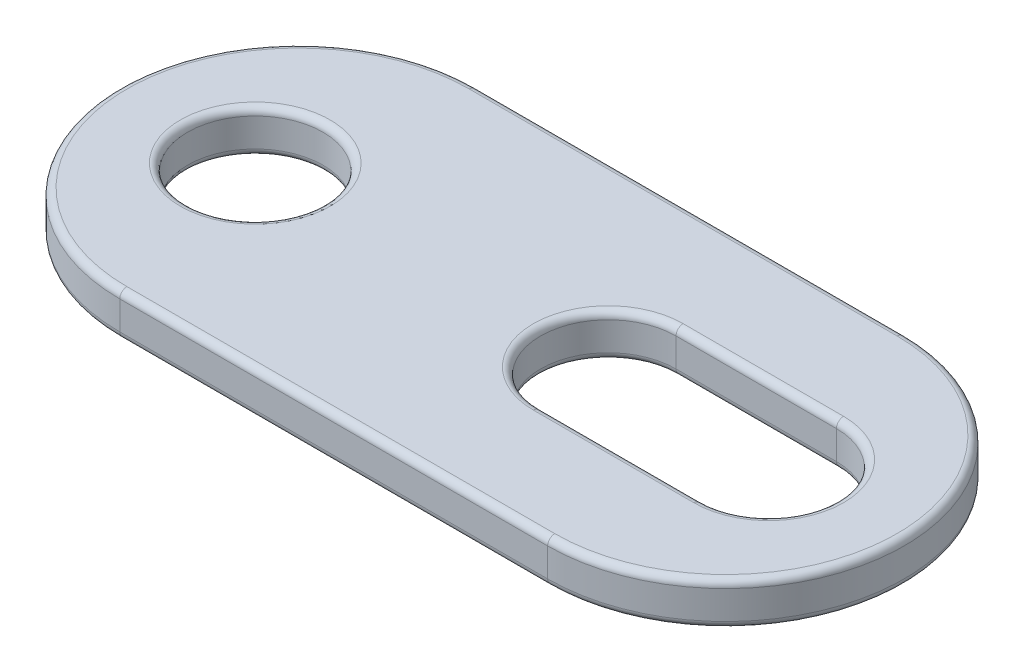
ISO-10303-21;
HEADER;
FILE_DESCRIPTION(('STEP AP214'),'2;1');
FILE_NAME('part.step','',(''),(''),'','','');
FILE_SCHEMA(('AUTOMOTIVE_DESIGN { 1 0 10303 214 1 1 1 1 }'));
ENDSEC;
DATA;
#1=APPLICATION_CONTEXT('core data for automotive mechanical design processes');
#2=APPLICATION_PROTOCOL_DEFINITION('international standard','automotive_design',2000,#1);
#3=PRODUCT_CONTEXT('',#1,'mechanical');
#4=PRODUCT('Part','Part','',(#3));
#5=PRODUCT_RELATED_PRODUCT_CATEGORY('part','',(#4));
#6=PRODUCT_DEFINITION_FORMATION('','',#4);
#7=PRODUCT_DEFINITION_CONTEXT('part definition',#1,'design');
#8=PRODUCT_DEFINITION('design','',#6,#7);
#9=PRODUCT_DEFINITION_SHAPE('','',#8);
#10=(LENGTH_UNIT() NAMED_UNIT(*) SI_UNIT(.MILLI.,.METRE.));
#11=(NAMED_UNIT(*) PLANE_ANGLE_UNIT() SI_UNIT($,.RADIAN.));
#12=(NAMED_UNIT(*) SI_UNIT($,.STERADIAN.) SOLID_ANGLE_UNIT());
#13=UNCERTAINTY_MEASURE_WITH_UNIT(LENGTH_MEASURE(1.E-05),#10,'distance_accuracy_value','');
#14=(GEOMETRIC_REPRESENTATION_CONTEXT(3) GLOBAL_UNCERTAINTY_ASSIGNED_CONTEXT((#13)) GLOBAL_UNIT_ASSIGNED_CONTEXT((#10,
#11,#12)) REPRESENTATION_CONTEXT('',''));
#15=CARTESIAN_POINT('',(0.,0.,0.));
#16=DIRECTION('',(0.,0.,1.));
#17=DIRECTION('',(1.,0.,0.));
#18=AXIS2_PLACEMENT_3D('',#15,#16,#17);
#19=CARTESIAN_POINT('',(0.,1.524,-6.35));
#20=DIRECTION('',(0.,1.,0.));
#21=DIRECTION('',(0.,0.,1.));
#22=AXIS2_PLACEMENT_3D('',#19,#20,#21);
#23=PLANE('',#22);
#24=DIRECTION('',(-1.,0.,0.));
#25=VECTOR('',#24,1.);
#26=CARTESIAN_POINT('',(0.,1.524,-9.017));
#27=LINE('',#26,#25);
#28=CARTESIAN_POINT('',(11.049,1.524,-9.017));
#29=VERTEX_POINT('',#28);
#30=CARTESIAN_POINT('',(16.764,1.524,-9.017));
#31=VERTEX_POINT('',#30);
#32=EDGE_CURVE('E44',#29,#31,#27,.F.);
#33=ORIENTED_EDGE('',*,*,#32,.T.);
#34=CARTESIAN_POINT('',(16.764,1.524,-6.35));
#35=DIRECTION('',(0.,1.,0.));
#36=DIRECTION('',(0.,0.,1.));
#37=AXIS2_PLACEMENT_3D('',#34,#35,#36);
#38=CIRCLE('',#37,2.667);
#39=CARTESIAN_POINT('',(16.764,1.524,-3.683));
#40=VERTEX_POINT('',#39);
#41=EDGE_CURVE('E12',#31,#40,#38,.F.);
#42=ORIENTED_EDGE('',*,*,#41,.T.);
#43=DIRECTION('',(1.,0.,0.));
#44=VECTOR('',#43,1.);
#45=CARTESIAN_POINT('',(0.,1.524,-3.683));
#46=LINE('',#45,#44);
#47=CARTESIAN_POINT('',(11.049,1.524,-3.683));
#48=VERTEX_POINT('',#47);
#49=EDGE_CURVE('E240',#40,#48,#46,.F.);
#50=ORIENTED_EDGE('',*,*,#49,.T.);
#51=CARTESIAN_POINT('',(11.049,1.524,-6.35));
#52=DIRECTION('',(0.,1.,0.));
#53=DIRECTION('',(0.,0.,1.));
#54=AXIS2_PLACEMENT_3D('',#51,#52,#53);
#55=CIRCLE('',#54,2.667);
#56=EDGE_CURVE('E54',#48,#29,#55,.F.);
#57=ORIENTED_EDGE('',*,*,#56,.T.);
#58=EDGE_LOOP('',(#33,#42,#50,#57));
#59=FACE_BOUND('',#58,.T.);
#60=CARTESIAN_POINT('',(15.24,1.524,-6.35));
#61=DIRECTION('',(0.,1.,0.));
#62=DIRECTION('',(0.,0.,1.));
#63=AXIS2_PLACEMENT_3D('',#60,#61,#62);
#64=CIRCLE('',#63,6.096);
#65=CARTESIAN_POINT('',(15.24,1.524,-0.254));
#66=VERTEX_POINT('',#65);
#67=CARTESIAN_POINT('',(15.24,1.524,-12.446));
#68=VERTEX_POINT('',#67);
#69=EDGE_CURVE('E235',#66,#68,#64,.T.);
#70=ORIENTED_EDGE('',*,*,#69,.T.);
#71=DIRECTION('',(-1.,0.,0.));
#72=VECTOR('',#71,1.);
#73=CARTESIAN_POINT('',(0.,1.524,-12.446));
#74=LINE('',#73,#72);
#75=CARTESIAN_POINT('',(0.,1.524,-12.446));
#76=VERTEX_POINT('',#75);
#77=EDGE_CURVE('E237',#68,#76,#74,.T.);
#78=ORIENTED_EDGE('',*,*,#77,.T.);
#79=CARTESIAN_POINT('',(0.,1.524,-6.35));
#80=DIRECTION('',(0.,1.,0.));
#81=DIRECTION('',(0.,0.,1.));
#82=AXIS2_PLACEMENT_3D('',#79,#80,#81);
#83=CIRCLE('',#82,6.096);
#84=CARTESIAN_POINT('',(0.,1.524,-0.254));
#85=VERTEX_POINT('',#84);
#86=EDGE_CURVE('E231',#76,#85,#83,.T.);
#87=ORIENTED_EDGE('',*,*,#86,.T.);
#88=DIRECTION('',(1.,0.,0.));
#89=VECTOR('',#88,1.);
#90=CARTESIAN_POINT('',(15.24,1.524,-0.254));
#91=LINE('',#90,#89);
#92=EDGE_CURVE('E233',#85,#66,#91,.T.);
#93=ORIENTED_EDGE('',*,*,#92,.T.);
#94=EDGE_LOOP('',(#70,#78,#87,#93));
#95=FACE_BOUND('',#94,.T.);
#96=CARTESIAN_POINT('',(-1.524,1.524,-6.35));
#97=DIRECTION('',(0.,1.,0.));
#98=DIRECTION('',(0.,0.,1.));
#99=AXIS2_PLACEMENT_3D('',#96,#97,#98);
#100=CIRCLE('',#99,2.667);
#101=CARTESIAN_POINT('',(-1.524,1.524,-3.683));
#102=VERTEX_POINT('',#101);
#103=EDGE_CURVE('E228',#102,#102,#100,.F.);
#104=ORIENTED_EDGE('',*,*,#103,.T.);
#105=EDGE_LOOP('',(#104));
#106=FACE_BOUND('',#105,.T.);
#107=ADVANCED_FACE('F36',(#59,#95,#106),#23,.T.);
#108=CARTESIAN_POINT('',(0.,0.,-6.35));
#109=DIRECTION('',(0.,1.,0.));
#110=DIRECTION('',(0.,0.,1.));
#111=AXIS2_PLACEMENT_3D('',#108,#109,#110);
#112=PLANE('',#111);
#113=CARTESIAN_POINT('',(16.764,0.,-6.35));
#114=DIRECTION('',(0.,1.,0.));
#115=DIRECTION('',(0.,0.,1.));
#116=AXIS2_PLACEMENT_3D('',#113,#114,#115);
#117=CIRCLE('',#116,2.667);
#118=CARTESIAN_POINT('',(16.764,0.,-3.683));
#119=VERTEX_POINT('',#118);
#120=CARTESIAN_POINT('',(16.764,0.,-9.017));
#121=VERTEX_POINT('',#120);
#122=EDGE_CURVE('E183',#119,#121,#117,.T.);
#123=ORIENTED_EDGE('',*,*,#122,.T.);
#124=DIRECTION('',(-1.,0.,0.));
#125=VECTOR('',#124,1.);
#126=CARTESIAN_POINT('',(11.049,0.,-9.017));
#127=LINE('',#126,#125);
#128=CARTESIAN_POINT('',(11.049,0.,-9.017));
#129=VERTEX_POINT('',#128);
#130=EDGE_CURVE('E185',#121,#129,#127,.T.);
#131=ORIENTED_EDGE('',*,*,#130,.T.);
#132=CARTESIAN_POINT('',(11.049,0.,-6.35));
#133=DIRECTION('',(0.,1.,0.));
#134=DIRECTION('',(0.,0.,1.));
#135=AXIS2_PLACEMENT_3D('',#132,#133,#134);
#136=CIRCLE('',#135,2.667);
#137=CARTESIAN_POINT('',(11.049,0.,-3.683));
#138=VERTEX_POINT('',#137);
#139=EDGE_CURVE('E175',#129,#138,#136,.T.);
#140=ORIENTED_EDGE('',*,*,#139,.T.);
#141=DIRECTION('',(1.,0.,0.));
#142=VECTOR('',#141,1.);
#143=CARTESIAN_POINT('',(16.764,0.,-3.683));
#144=LINE('',#143,#142);
#145=EDGE_CURVE('E177',#138,#119,#144,.T.);
#146=ORIENTED_EDGE('',*,*,#145,.T.);
#147=EDGE_LOOP('',(#123,#131,#140,#146));
#148=FACE_BOUND('',#147,.T.);
#149=CARTESIAN_POINT('',(15.24,0.,-6.35));
#150=DIRECTION('',(0.,1.,0.));
#151=DIRECTION('',(0.,0.,1.));
#152=AXIS2_PLACEMENT_3D('',#149,#150,#151);
#153=CIRCLE('',#152,6.096);
#154=CARTESIAN_POINT('',(15.24,0.,-12.446));
#155=VERTEX_POINT('',#154);
#156=CARTESIAN_POINT('',(15.24,0.,-0.254));
#157=VERTEX_POINT('',#156);
#158=EDGE_CURVE('E174',#155,#157,#153,.F.);
#159=ORIENTED_EDGE('',*,*,#158,.T.);
#160=DIRECTION('',(1.,0.,0.));
#161=VECTOR('',#160,1.);
#162=CARTESIAN_POINT('',(0.,0.,-0.254));
#163=LINE('',#162,#161);
#164=CARTESIAN_POINT('',(0.,0.,-0.254));
#165=VERTEX_POINT('',#164);
#166=EDGE_CURVE('E152',#157,#165,#163,.F.);
#167=ORIENTED_EDGE('',*,*,#166,.T.);
#168=CARTESIAN_POINT('',(0.,0.,-6.35));
#169=DIRECTION('',(0.,1.,0.));
#170=DIRECTION('',(0.,0.,1.));
#171=AXIS2_PLACEMENT_3D('',#168,#169,#170);
#172=CIRCLE('',#171,6.096);
#173=CARTESIAN_POINT('',(0.,0.,-12.446));
#174=VERTEX_POINT('',#173);
#175=EDGE_CURVE('E162',#165,#174,#172,.F.);
#176=ORIENTED_EDGE('',*,*,#175,.T.);
#177=DIRECTION('',(-1.,0.,0.));
#178=VECTOR('',#177,1.);
#179=CARTESIAN_POINT('',(0.,0.,-12.446));
#180=LINE('',#179,#178);
#181=EDGE_CURVE('E168',#174,#155,#180,.F.);
#182=ORIENTED_EDGE('',*,*,#181,.T.);
#183=EDGE_LOOP('',(#159,#167,#176,#182));
#184=FACE_BOUND('',#183,.T.);
#185=CARTESIAN_POINT('',(-1.524,0.,-6.35));
#186=DIRECTION('',(0.,1.,0.));
#187=DIRECTION('',(0.,0.,1.));
#188=AXIS2_PLACEMENT_3D('',#185,#186,#187);
#189=CIRCLE('',#188,2.667);
#190=CARTESIAN_POINT('',(-1.524,0.,-3.683));
#191=VERTEX_POINT('',#190);
#192=EDGE_CURVE('E169',#191,#191,#189,.T.);
#193=ORIENTED_EDGE('',*,*,#192,.T.);
#194=EDGE_LOOP('',(#193));
#195=FACE_BOUND('',#194,.T.);
#196=ADVANCED_FACE('F171',(#148,#184,#195),#112,.F.);
#197=CARTESIAN_POINT('',(0.,1.524,-6.35));
#198=DIRECTION('',(0.,-1.,0.));
#199=DIRECTION('',(0.,0.,-1.));
#200=AXIS2_PLACEMENT_3D('',#197,#198,#199);
#201=CYLINDRICAL_SURFACE('',#200,6.35);
#202=DIRECTION('',(0.,-1.,0.));
#203=VECTOR('',#202,1.);
#204=CARTESIAN_POINT('',(0.,1.524,-12.7));
#205=LINE('',#204,#203);
#206=CARTESIAN_POINT('',(0.,1.27,-12.7));
#207=VERTEX_POINT('',#206);
#208=CARTESIAN_POINT('',(0.,0.254000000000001,-12.7));
#209=VERTEX_POINT('',#208);
#210=EDGE_CURVE('E287',#207,#209,#205,.T.);
#211=ORIENTED_EDGE('',*,*,#210,.T.);
#212=CARTESIAN_POINT('',(0.,0.254,-6.35));
#213=DIRECTION('',(0.,1.,0.));
#214=DIRECTION('',(0.,0.,1.));
#215=AXIS2_PLACEMENT_3D('',#212,#213,#214);
#216=CIRCLE('',#215,6.35);
#217=CARTESIAN_POINT('',(0.,0.254000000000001,0.));
#218=VERTEX_POINT('',#217);
#219=EDGE_CURVE('E220',#209,#218,#216,.T.);
#220=ORIENTED_EDGE('',*,*,#219,.T.);
#221=DIRECTION('',(0.,-1.,0.));
#222=VECTOR('',#221,1.);
#223=CARTESIAN_POINT('',(0.,1.524,0.));
#224=LINE('',#223,#222);
#225=CARTESIAN_POINT('',(0.,1.27,0.));
#226=VERTEX_POINT('',#225);
#227=EDGE_CURVE('E296',#226,#218,#224,.T.);
#228=ORIENTED_EDGE('',*,*,#227,.F.);
#229=CARTESIAN_POINT('',(0.,1.27,-6.35));
#230=DIRECTION('',(0.,1.,0.));
#231=DIRECTION('',(0.,0.,1.));
#232=AXIS2_PLACEMENT_3D('',#229,#230,#231);
#233=CIRCLE('',#232,6.35);
#234=EDGE_CURVE('E218',#226,#207,#233,.F.);
#235=ORIENTED_EDGE('',*,*,#234,.T.);
#236=EDGE_LOOP('',(#211,#220,#228,#235));
#237=FACE_BOUND('',#236,.T.);
#238=ADVANCED_FACE('F38',(#237),#201,.T.);
#239=CARTESIAN_POINT('',(0.,1.524,0.));
#240=DIRECTION('',(0.,0.,-1.));
#241=DIRECTION('',(-1.,0.,0.));
#242=AXIS2_PLACEMENT_3D('',#239,#240,#241);
#243=PLANE('',#242);
#244=ORIENTED_EDGE('',*,*,#227,.T.);
#245=DIRECTION('',(1.,0.,0.));
#246=VECTOR('',#245,1.);
#247=CARTESIAN_POINT('',(0.,0.254,0.));
#248=LINE('',#247,#246);
#249=CARTESIAN_POINT('',(15.24,0.254000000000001,0.));
#250=VERTEX_POINT('',#249);
#251=EDGE_CURVE('E155',#218,#250,#248,.T.);
#252=ORIENTED_EDGE('',*,*,#251,.T.);
#253=DIRECTION('',(0.,-1.,0.));
#254=VECTOR('',#253,1.);
#255=CARTESIAN_POINT('',(15.24,1.524,0.));
#256=LINE('',#255,#254);
#257=CARTESIAN_POINT('',(15.24,1.27,0.));
#258=VERTEX_POINT('',#257);
#259=EDGE_CURVE('E293',#258,#250,#256,.T.);
#260=ORIENTED_EDGE('',*,*,#259,.F.);
#261=DIRECTION('',(1.,0.,0.));
#262=VECTOR('',#261,1.);
#263=CARTESIAN_POINT('',(0.,1.27,0.));
#264=LINE('',#263,#262);
#265=EDGE_CURVE('E206',#258,#226,#264,.F.);
#266=ORIENTED_EDGE('',*,*,#265,.T.);
#267=EDGE_LOOP('',(#244,#252,#260,#266));
#268=FACE_BOUND('',#267,.T.);
#269=ADVANCED_FACE('F311',(#268),#243,.F.);
#270=CARTESIAN_POINT('',(15.24,1.524,-6.35));
#271=DIRECTION('',(0.,-1.,0.));
#272=DIRECTION('',(0.,0.,-1.));
#273=AXIS2_PLACEMENT_3D('',#270,#271,#272);
#274=CYLINDRICAL_SURFACE('',#273,6.35);
#275=ORIENTED_EDGE('',*,*,#259,.T.);
#276=CARTESIAN_POINT('',(15.24,0.254,-6.35));
#277=DIRECTION('',(0.,1.,0.));
#278=DIRECTION('',(0.,0.,1.));
#279=AXIS2_PLACEMENT_3D('',#276,#277,#278);
#280=CIRCLE('',#279,6.35);
#281=CARTESIAN_POINT('',(15.24,0.254000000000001,-12.7));
#282=VERTEX_POINT('',#281);
#283=EDGE_CURVE('E211',#250,#282,#280,.T.);
#284=ORIENTED_EDGE('',*,*,#283,.T.);
#285=DIRECTION('',(0.,-1.,0.));
#286=VECTOR('',#285,1.);
#287=CARTESIAN_POINT('',(15.24,1.524,-12.7));
#288=LINE('',#287,#286);
#289=CARTESIAN_POINT('',(15.24,1.27,-12.7));
#290=VERTEX_POINT('',#289);
#291=EDGE_CURVE('E290',#290,#282,#288,.T.);
#292=ORIENTED_EDGE('',*,*,#291,.F.);
#293=CARTESIAN_POINT('',(15.24,1.27,-6.35));
#294=DIRECTION('',(0.,1.,0.));
#295=DIRECTION('',(0.,0.,1.));
#296=AXIS2_PLACEMENT_3D('',#293,#294,#295);
#297=CIRCLE('',#296,6.35);
#298=EDGE_CURVE('E209',#290,#258,#297,.F.);
#299=ORIENTED_EDGE('',*,*,#298,.T.);
#300=EDGE_LOOP('',(#275,#284,#292,#299));
#301=FACE_BOUND('',#300,.T.);
#302=ADVANCED_FACE('F314',(#301),#274,.T.);
#303=CARTESIAN_POINT('',(0.,1.524,-12.7));
#304=DIRECTION('',(0.,0.,1.));
#305=DIRECTION('',(1.,0.,0.));
#306=AXIS2_PLACEMENT_3D('',#303,#304,#305);
#307=PLANE('',#306);
#308=ORIENTED_EDGE('',*,*,#291,.T.);
#309=DIRECTION('',(-1.,0.,0.));
#310=VECTOR('',#309,1.);
#311=CARTESIAN_POINT('',(0.,0.254,-12.7));
#312=LINE('',#311,#310);
#313=EDGE_CURVE('E216',#282,#209,#312,.T.);
#314=ORIENTED_EDGE('',*,*,#313,.T.);
#315=ORIENTED_EDGE('',*,*,#210,.F.);
#316=DIRECTION('',(-1.,0.,0.));
#317=VECTOR('',#316,1.);
#318=CARTESIAN_POINT('',(15.24,1.27,-12.7));
#319=LINE('',#318,#317);
#320=EDGE_CURVE('E213',#207,#290,#319,.F.);
#321=ORIENTED_EDGE('',*,*,#320,.T.);
#322=EDGE_LOOP('',(#308,#314,#315,#321));
#323=FACE_BOUND('',#322,.T.);
#324=ADVANCED_FACE('F328',(#323),#307,.F.);
#325=CARTESIAN_POINT('',(-1.524,1.524,-6.35));
#326=DIRECTION('',(0.,-1.,0.));
#327=DIRECTION('',(0.,0.,-1.));
#328=AXIS2_PLACEMENT_3D('',#325,#326,#327);
#329=CYLINDRICAL_SURFACE('',#328,2.413);
#330=CARTESIAN_POINT('',(-1.524,0.254,-6.35));
#331=DIRECTION('',(0.,1.,0.));
#332=DIRECTION('',(0.,0.,1.));
#333=AXIS2_PLACEMENT_3D('',#330,#331,#332);
#334=CIRCLE('',#333,2.413);
#335=CARTESIAN_POINT('',(-1.524,0.254,-8.763));
#336=VERTEX_POINT('',#335);
#337=EDGE_CURVE('E225',#336,#336,#334,.F.);
#338=CARTESIAN_POINT('',(-1.524,1.27,-6.35));
#339=DIRECTION('',(0.,1.,0.));
#340=DIRECTION('',(0.,0.,1.));
#341=AXIS2_PLACEMENT_3D('',#338,#339,#340);
#342=CIRCLE('',#341,2.413);
#343=CARTESIAN_POINT('',(-1.524,1.27,-8.763));
#344=VERTEX_POINT('',#343);
#345=EDGE_CURVE('E222',#344,#344,#342,.T.);
#346=CARTESIAN_POINT('',(-1.524,0.254,-8.763));
#347=CARTESIAN_POINT('',(-1.524,0.264583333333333,-8.763));
#348=CARTESIAN_POINT('',(-1.524,0.275166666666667,-8.763));
#349=CARTESIAN_POINT('',(-1.524,0.296333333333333,-8.763));
#350=CARTESIAN_POINT('',(-1.524,0.306916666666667,-8.763));
#351=CARTESIAN_POINT('',(-1.524,0.328083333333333,-8.763));
#352=CARTESIAN_POINT('',(-1.524,0.338666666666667,-8.763));
#353=CARTESIAN_POINT('',(-1.524,0.359833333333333,-8.763));
#354=CARTESIAN_POINT('',(-1.524,0.370416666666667,-8.763));
#355=CARTESIAN_POINT('',(-1.524,0.391583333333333,-8.763));
#356=CARTESIAN_POINT('',(-1.524,0.402166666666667,-8.763));
#357=CARTESIAN_POINT('',(-1.524,0.423333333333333,-8.763));
#358=CARTESIAN_POINT('',(-1.524,0.433916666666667,-8.763));
#359=CARTESIAN_POINT('',(-1.524,0.455083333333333,-8.763));
#360=CARTESIAN_POINT('',(-1.524,0.465666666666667,-8.763));
#361=CARTESIAN_POINT('',(-1.524,0.486833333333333,-8.763));
#362=CARTESIAN_POINT('',(-1.524,0.497416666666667,-8.763));
#363=CARTESIAN_POINT('',(-1.524,0.518583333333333,-8.763));
#364=CARTESIAN_POINT('',(-1.524,0.529166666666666,-8.763));
#365=CARTESIAN_POINT('',(-1.524,0.550333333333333,-8.763));
#366=CARTESIAN_POINT('',(-1.524,0.560916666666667,-8.763));
#367=CARTESIAN_POINT('',(-1.524,0.582083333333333,-8.763));
#368=CARTESIAN_POINT('',(-1.524,0.592666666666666,-8.763));
#369=CARTESIAN_POINT('',(-1.524,0.613833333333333,-8.763));
#370=CARTESIAN_POINT('',(-1.524,0.624416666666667,-8.763));
#371=CARTESIAN_POINT('',(-1.524,0.645583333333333,-8.763));
#372=CARTESIAN_POINT('',(-1.524,0.656166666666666,-8.763));
#373=CARTESIAN_POINT('',(-1.524,0.677333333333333,-8.763));
#374=CARTESIAN_POINT('',(-1.524,0.687916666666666,-8.763));
#375=CARTESIAN_POINT('',(-1.524,0.709083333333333,-8.763));
#376=CARTESIAN_POINT('',(-1.524,0.719666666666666,-8.763));
#377=CARTESIAN_POINT('',(-1.524,0.740833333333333,-8.763));
#378=CARTESIAN_POINT('',(-1.524,0.751416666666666,-8.763));
#379=CARTESIAN_POINT('',(-1.524,0.772583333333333,-8.763));
#380=CARTESIAN_POINT('',(-1.524,0.783166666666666,-8.763));
#381=CARTESIAN_POINT('',(-1.524,0.804333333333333,-8.763));
#382=CARTESIAN_POINT('',(-1.524,0.814916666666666,-8.763));
#383=CARTESIAN_POINT('',(-1.524,0.836083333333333,-8.763));
#384=CARTESIAN_POINT('',(-1.524,0.846666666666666,-8.763));
#385=CARTESIAN_POINT('',(-1.524,0.867833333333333,-8.763));
#386=CARTESIAN_POINT('',(-1.524,0.878416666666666,-8.763));
#387=CARTESIAN_POINT('',(-1.524,0.899583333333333,-8.763));
#388=CARTESIAN_POINT('',(-1.524,0.910166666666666,-8.763));
#389=CARTESIAN_POINT('',(-1.524,0.931333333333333,-8.763));
#390=CARTESIAN_POINT('',(-1.524,0.941916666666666,-8.763));
#391=CARTESIAN_POINT('',(-1.524,0.963083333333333,-8.763));
#392=CARTESIAN_POINT('',(-1.524,0.973666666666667,-8.763));
#393=CARTESIAN_POINT('',(-1.524,0.994833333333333,-8.763));
#394=CARTESIAN_POINT('',(-1.524,1.00541666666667,-8.763));
#395=CARTESIAN_POINT('',(-1.524,1.02658333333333,-8.763));
#396=CARTESIAN_POINT('',(-1.524,1.03716666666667,-8.763));
#397=CARTESIAN_POINT('',(-1.524,1.05833333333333,-8.763));
#398=CARTESIAN_POINT('',(-1.524,1.06891666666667,-8.763));
#399=CARTESIAN_POINT('',(-1.524,1.09008333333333,-8.763));
#400=CARTESIAN_POINT('',(-1.524,1.10066666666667,-8.763));
#401=CARTESIAN_POINT('',(-1.524,1.12183333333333,-8.763));
#402=CARTESIAN_POINT('',(-1.524,1.13241666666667,-8.763));
#403=CARTESIAN_POINT('',(-1.524,1.15358333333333,-8.763));
#404=CARTESIAN_POINT('',(-1.524,1.16416666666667,-8.763));
#405=CARTESIAN_POINT('',(-1.524,1.18533333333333,-8.763));
#406=CARTESIAN_POINT('',(-1.524,1.19591666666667,-8.763));
#407=CARTESIAN_POINT('',(-1.524,1.21708333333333,-8.763));
#408=CARTESIAN_POINT('',(-1.524,1.22766666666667,-8.763));
#409=CARTESIAN_POINT('',(-1.524,1.24883333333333,-8.763));
#410=CARTESIAN_POINT('',(-1.524,1.25941666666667,-8.763));
#411=CARTESIAN_POINT('',(-1.524,1.27,-8.763));
#412=B_SPLINE_CURVE_WITH_KNOTS('',3,(#346,#347,#348,#349,#350,#351,#352,#353,#354,#355,#356,
#357,#358,#359,#360,#361,#362,#363,#364,#365,#366,#367,#368,#369,#370,#371,#372,#373,#374,#375,
#376,#377,#378,#379,#380,#381,#382,#383,#384,#385,#386,#387,#388,#389,#390,#391,#392,#393,#394,
#395,#396,#397,#398,#399,#400,#401,#402,#403,#404,#405,#406,#407,#408,#409,#410,#411),
.UNSPECIFIED.,.F.,.F.,(4,2,2,2,2,2,2,2,2,2,2,2,2,2,2,2,2,2,2,2,2,2,2,2,2,2,2,2,2,2,2,2,4),(0.,
0.0317500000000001,0.0635,0.0952500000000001,0.127,0.15875,0.1905,0.22225,0.254,0.28575,0.3175,
0.34925,0.381,0.41275,0.4445,0.47625,0.508,0.53975,0.5715,0.60325,0.635,0.66675,0.6985,0.73025,
0.762,0.79375,0.8255,0.85725,0.889,0.92075,0.9525,0.98425,1.016),.UNSPECIFIED.);
#413=EDGE_CURVE('BSEAM399',#336,#344,#412,.T.);
#414=ORIENTED_EDGE('',*,*,#337,.T.);
#415=ORIENTED_EDGE('',*,*,#345,.T.);
#416=ORIENTED_EDGE('',*,*,#413,.T.);
#417=ORIENTED_EDGE('',*,*,#413,.F.);
#418=EDGE_LOOP('',(#414,#416,#415,#417));
#419=FACE_BOUND('',#418,.T.);
#420=ADVANCED_FACE('F399',(#419),#329,.F.);
#421=CARTESIAN_POINT('',(11.049,1.524,-6.35));
#422=DIRECTION('',(0.,-1.,0.));
#423=DIRECTION('',(0.,0.,-1.));
#424=AXIS2_PLACEMENT_3D('',#421,#422,#423);
#425=CYLINDRICAL_SURFACE('',#424,2.413);
#426=DIRECTION('',(0.,-1.,0.));
#427=VECTOR('',#426,1.);
#428=CARTESIAN_POINT('',(11.049,1.524,-3.937));
#429=LINE('',#428,#427);
#430=CARTESIAN_POINT('',(11.049,1.27,-3.937));
#431=VERTEX_POINT('',#430);
#432=CARTESIAN_POINT('',(11.049,0.254000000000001,-3.937));
#433=VERTEX_POINT('',#432);
#434=EDGE_CURVE('E284',#431,#433,#429,.T.);
#435=ORIENTED_EDGE('',*,*,#434,.T.);
#436=CARTESIAN_POINT('',(11.049,0.254,-6.35));
#437=DIRECTION('',(0.,1.,0.));
#438=DIRECTION('',(0.,0.,1.));
#439=AXIS2_PLACEMENT_3D('',#436,#437,#438);
#440=CIRCLE('',#439,2.413);
#441=CARTESIAN_POINT('',(11.049,0.254000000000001,-8.763));
#442=VERTEX_POINT('',#441);
#443=EDGE_CURVE('E204',#433,#442,#440,.F.);
#444=ORIENTED_EDGE('',*,*,#443,.T.);
#445=DIRECTION('',(0.,-1.,0.));
#446=VECTOR('',#445,1.);
#447=CARTESIAN_POINT('',(11.049,1.524,-8.763));
#448=LINE('',#447,#446);
#449=CARTESIAN_POINT('',(11.049,1.27,-8.763));
#450=VERTEX_POINT('',#449);
#451=EDGE_CURVE('E275',#450,#442,#448,.T.);
#452=ORIENTED_EDGE('',*,*,#451,.F.);
#453=CARTESIAN_POINT('',(11.049,1.27,-6.35));
#454=DIRECTION('',(0.,1.,0.));
#455=DIRECTION('',(0.,0.,1.));
#456=AXIS2_PLACEMENT_3D('',#453,#454,#455);
#457=CIRCLE('',#456,2.413);
#458=EDGE_CURVE('E202',#450,#431,#457,.T.);
#459=ORIENTED_EDGE('',*,*,#458,.T.);
#460=EDGE_LOOP('',(#435,#444,#452,#459));
#461=FACE_BOUND('',#460,.T.);
#462=ADVANCED_FACE('F422',(#461),#425,.F.);
#463=CARTESIAN_POINT('',(11.049,1.524,-3.937));
#464=DIRECTION('',(0.,0.,-1.));
#465=DIRECTION('',(-1.,0.,0.));
#466=AXIS2_PLACEMENT_3D('',#463,#464,#465);
#467=PLANE('',#466);
#468=DIRECTION('',(0.,-1.,0.));
#469=VECTOR('',#468,1.);
#470=CARTESIAN_POINT('',(16.764,1.524,-3.937));
#471=LINE('',#470,#469);
#472=CARTESIAN_POINT('',(16.764,1.27,-3.937));
#473=VERTEX_POINT('',#472);
#474=CARTESIAN_POINT('',(16.764,0.254000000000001,-3.937));
#475=VERTEX_POINT('',#474);
#476=EDGE_CURVE('E281',#473,#475,#471,.T.);
#477=ORIENTED_EDGE('',*,*,#476,.T.);
#478=DIRECTION('',(1.,0.,0.));
#479=VECTOR('',#478,1.);
#480=CARTESIAN_POINT('',(11.049,0.254,-3.937));
#481=LINE('',#480,#479);
#482=EDGE_CURVE('E200',#475,#433,#481,.F.);
#483=ORIENTED_EDGE('',*,*,#482,.T.);
#484=ORIENTED_EDGE('',*,*,#434,.F.);
#485=DIRECTION('',(1.,0.,0.));
#486=VECTOR('',#485,1.);
#487=CARTESIAN_POINT('',(11.049,1.27,-3.937));
#488=LINE('',#487,#486);
#489=EDGE_CURVE('E198',#431,#473,#488,.T.);
#490=ORIENTED_EDGE('',*,*,#489,.T.);
#491=EDGE_LOOP('',(#477,#483,#484,#490));
#492=FACE_BOUND('',#491,.T.);
#493=ADVANCED_FACE('F377',(#492),#467,.T.);
#494=CARTESIAN_POINT('',(16.764,1.524,-6.35));
#495=DIRECTION('',(0.,-1.,0.));
#496=DIRECTION('',(0.,0.,-1.));
#497=AXIS2_PLACEMENT_3D('',#494,#495,#496);
#498=CYLINDRICAL_SURFACE('',#497,2.413);
#499=DIRECTION('',(0.,-1.,0.));
#500=VECTOR('',#499,1.);
#501=CARTESIAN_POINT('',(16.764,1.524,-8.763));
#502=LINE('',#501,#500);
#503=CARTESIAN_POINT('',(16.764,1.27,-8.763));
#504=VERTEX_POINT('',#503);
#505=CARTESIAN_POINT('',(16.764,0.254000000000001,-8.763));
#506=VERTEX_POINT('',#505);
#507=EDGE_CURVE('E278',#504,#506,#502,.T.);
#508=ORIENTED_EDGE('',*,*,#507,.T.);
#509=CARTESIAN_POINT('',(16.764,0.254,-6.35));
#510=DIRECTION('',(0.,1.,0.));
#511=DIRECTION('',(0.,0.,1.));
#512=AXIS2_PLACEMENT_3D('',#509,#510,#511);
#513=CIRCLE('',#512,2.413);
#514=EDGE_CURVE('E196',#506,#475,#513,.F.);
#515=ORIENTED_EDGE('',*,*,#514,.T.);
#516=ORIENTED_EDGE('',*,*,#476,.F.);
#517=CARTESIAN_POINT('',(16.764,1.27,-6.35));
#518=DIRECTION('',(0.,1.,0.));
#519=DIRECTION('',(0.,0.,1.));
#520=AXIS2_PLACEMENT_3D('',#517,#518,#519);
#521=CIRCLE('',#520,2.413);
#522=EDGE_CURVE('E193',#473,#504,#521,.T.);
#523=ORIENTED_EDGE('',*,*,#522,.T.);
#524=EDGE_LOOP('',(#508,#515,#516,#523));
#525=FACE_BOUND('',#524,.T.);
#526=ADVANCED_FACE('F353',(#525),#498,.F.);
#527=CARTESIAN_POINT('',(11.049,1.524,-8.763));
#528=DIRECTION('',(0.,0.,1.));
#529=DIRECTION('',(1.,0.,0.));
#530=AXIS2_PLACEMENT_3D('',#527,#528,#529);
#531=PLANE('',#530);
#532=ORIENTED_EDGE('',*,*,#451,.T.);
#533=DIRECTION('',(-1.,0.,0.));
#534=VECTOR('',#533,1.);
#535=CARTESIAN_POINT('',(16.764,0.254,-8.763));
#536=LINE('',#535,#534);
#537=EDGE_CURVE('E190',#442,#506,#536,.F.);
#538=ORIENTED_EDGE('',*,*,#537,.T.);
#539=ORIENTED_EDGE('',*,*,#507,.F.);
#540=DIRECTION('',(-1.,0.,0.));
#541=VECTOR('',#540,1.);
#542=CARTESIAN_POINT('',(11.049,1.27,-8.763));
#543=LINE('',#542,#541);
#544=EDGE_CURVE('E188',#504,#450,#543,.T.);
#545=ORIENTED_EDGE('',*,*,#544,.T.);
#546=EDGE_LOOP('',(#532,#538,#539,#545));
#547=FACE_BOUND('',#546,.T.);
#548=ADVANCED_FACE('F355',(#547),#531,.T.);
#549=CARTESIAN_POINT('',(0.,0.254,-3.683));
#550=DIRECTION('',(-1.,0.,0.));
#551=DIRECTION('',(0.,0.,1.));
#552=AXIS2_PLACEMENT_3D('',#549,#550,#551);
#553=CYLINDRICAL_SURFACE('',#552,0.254);
#554=CARTESIAN_POINT('',(11.049,0.254,-3.683));
#555=DIRECTION('',(-1.,0.,0.));
#556=DIRECTION('',(0.,0.,1.));
#557=AXIS2_PLACEMENT_3D('',#554,#555,#556);
#558=CIRCLE('',#557,0.254);
#559=EDGE_CURVE('E269',#433,#138,#558,.T.);
#560=ORIENTED_EDGE('',*,*,#559,.F.);
#561=ORIENTED_EDGE('',*,*,#482,.F.);
#562=CARTESIAN_POINT('',(16.764,0.254,-3.683));
#563=DIRECTION('',(1.,0.,0.));
#564=DIRECTION('',(0.,0.,-1.));
#565=AXIS2_PLACEMENT_3D('',#562,#563,#564);
#566=CIRCLE('',#565,0.254);
#567=EDGE_CURVE('E272',#119,#475,#566,.T.);
#568=ORIENTED_EDGE('',*,*,#567,.F.);
#569=ORIENTED_EDGE('',*,*,#145,.F.);
#570=EDGE_LOOP('',(#560,#561,#568,#569));
#571=FACE_BOUND('',#570,.T.);
#572=ADVANCED_FACE('F380',(#571),#553,.T.);
#573=CARTESIAN_POINT('',(16.764,0.254,-6.35));
#574=DIRECTION('',(0.,1.,0.));
#575=DIRECTION('',(0.,0.,1.));
#576=AXIS2_PLACEMENT_3D('',#573,#574,#575);
#577=TOROIDAL_SURFACE('',#576,2.667,0.254);
#578=ORIENTED_EDGE('',*,*,#567,.T.);
#579=ORIENTED_EDGE('',*,*,#514,.F.);
#580=CARTESIAN_POINT('',(16.764,0.254,-9.017));
#581=DIRECTION('',(-1.,0.,0.));
#582=DIRECTION('',(0.,0.,1.));
#583=AXIS2_PLACEMENT_3D('',#580,#581,#582);
#584=CIRCLE('',#583,0.254);
#585=EDGE_CURVE('E267',#121,#506,#584,.T.);
#586=ORIENTED_EDGE('',*,*,#585,.F.);
#587=ORIENTED_EDGE('',*,*,#122,.F.);
#588=EDGE_LOOP('',(#578,#579,#586,#587));
#589=FACE_BOUND('',#588,.T.);
#590=ADVANCED_FACE('F374',(#589),#577,.T.);
#591=CARTESIAN_POINT('',(11.049,0.254,-6.35));
#592=DIRECTION('',(0.,1.,0.));
#593=DIRECTION('',(0.,0.,1.));
#594=AXIS2_PLACEMENT_3D('',#591,#592,#593);
#595=TOROIDAL_SURFACE('',#594,2.667,0.254);
#596=ORIENTED_EDGE('',*,*,#559,.T.);
#597=ORIENTED_EDGE('',*,*,#139,.F.);
#598=CARTESIAN_POINT('',(11.049,0.254,-9.017));
#599=DIRECTION('',(1.,0.,0.));
#600=DIRECTION('',(0.,0.,-1.));
#601=AXIS2_PLACEMENT_3D('',#598,#599,#600);
#602=CIRCLE('',#601,0.254);
#603=EDGE_CURVE('E265',#442,#129,#602,.T.);
#604=ORIENTED_EDGE('',*,*,#603,.F.);
#605=ORIENTED_EDGE('',*,*,#443,.F.);
#606=EDGE_LOOP('',(#596,#597,#604,#605));
#607=FACE_BOUND('',#606,.T.);
#608=ADVANCED_FACE('F367',(#607),#595,.T.);
#609=CARTESIAN_POINT('',(0.,0.254,-9.017));
#610=DIRECTION('',(1.,0.,0.));
#611=DIRECTION('',(0.,0.,-1.));
#612=AXIS2_PLACEMENT_3D('',#609,#610,#611);
#613=CYLINDRICAL_SURFACE('',#612,0.254);
#614=ORIENTED_EDGE('',*,*,#585,.T.);
#615=ORIENTED_EDGE('',*,*,#537,.F.);
#616=ORIENTED_EDGE('',*,*,#603,.T.);
#617=ORIENTED_EDGE('',*,*,#130,.F.);
#618=EDGE_LOOP('',(#614,#615,#616,#617));
#619=FACE_BOUND('',#618,.T.);
#620=ADVANCED_FACE('F360',(#619),#613,.T.);
#621=CARTESIAN_POINT('',(0.,0.254,-12.446));
#622=DIRECTION('',(-1.,0.,0.));
#623=DIRECTION('',(0.,0.,1.));
#624=AXIS2_PLACEMENT_3D('',#621,#622,#623);
#625=CYLINDRICAL_SURFACE('',#624,0.254);
#626=CARTESIAN_POINT('',(15.24,0.254,-12.446));
#627=DIRECTION('',(1.,0.,0.));
#628=DIRECTION('',(0.,0.,-1.));
#629=AXIS2_PLACEMENT_3D('',#626,#627,#628);
#630=CIRCLE('',#629,0.254);
#631=EDGE_CURVE('E158',#155,#282,#630,.T.);
#632=ORIENTED_EDGE('',*,*,#631,.F.);
#633=ORIENTED_EDGE('',*,*,#181,.F.);
#634=CARTESIAN_POINT('',(0.,0.254,-12.446));
#635=DIRECTION('',(-1.,0.,0.));
#636=DIRECTION('',(0.,0.,1.));
#637=AXIS2_PLACEMENT_3D('',#634,#635,#636);
#638=CIRCLE('',#637,0.254);
#639=EDGE_CURVE('E165',#209,#174,#638,.T.);
#640=ORIENTED_EDGE('',*,*,#639,.F.);
#641=ORIENTED_EDGE('',*,*,#313,.F.);
#642=EDGE_LOOP('',(#632,#633,#640,#641));
#643=FACE_BOUND('',#642,.T.);
#644=ADVANCED_FACE('F303',(#643),#625,.T.);
#645=CARTESIAN_POINT('',(0.,0.254,-6.35));
#646=DIRECTION('',(0.,1.,0.));
#647=DIRECTION('',(0.,0.,1.));
#648=AXIS2_PLACEMENT_3D('',#645,#646,#647);
#649=TOROIDAL_SURFACE('',#648,6.096,0.254);
#650=ORIENTED_EDGE('',*,*,#639,.T.);
#651=ORIENTED_EDGE('',*,*,#175,.F.);
#652=CARTESIAN_POINT('',(0.,0.254,-0.254));
#653=DIRECTION('',(1.,0.,0.));
#654=DIRECTION('',(0.,0.,-1.));
#655=AXIS2_PLACEMENT_3D('',#652,#653,#654);
#656=CIRCLE('',#655,0.254);
#657=EDGE_CURVE('E148',#218,#165,#656,.T.);
#658=ORIENTED_EDGE('',*,*,#657,.F.);
#659=ORIENTED_EDGE('',*,*,#219,.F.);
#660=EDGE_LOOP('',(#650,#651,#658,#659));
#661=FACE_BOUND('',#660,.T.);
#662=ADVANCED_FACE('F163',(#661),#649,.T.);
#663=CARTESIAN_POINT('',(15.24,0.254,-6.35));
#664=DIRECTION('',(0.,1.,0.));
#665=DIRECTION('',(0.,0.,1.));
#666=AXIS2_PLACEMENT_3D('',#663,#664,#665);
#667=TOROIDAL_SURFACE('',#666,6.096,0.254);
#668=ORIENTED_EDGE('',*,*,#631,.T.);
#669=ORIENTED_EDGE('',*,*,#283,.F.);
#670=CARTESIAN_POINT('',(15.24,0.254,-0.254));
#671=DIRECTION('',(-1.,0.,0.));
#672=DIRECTION('',(0.,0.,1.));
#673=AXIS2_PLACEMENT_3D('',#670,#671,#672);
#674=CIRCLE('',#673,0.254);
#675=EDGE_CURVE('E159',#157,#250,#674,.T.);
#676=ORIENTED_EDGE('',*,*,#675,.F.);
#677=ORIENTED_EDGE('',*,*,#158,.F.);
#678=EDGE_LOOP('',(#668,#669,#676,#677));
#679=FACE_BOUND('',#678,.T.);
#680=ADVANCED_FACE('F306',(#679),#667,.T.);
#681=CARTESIAN_POINT('',(0.,0.254,-0.254));
#682=DIRECTION('',(1.,0.,0.));
#683=DIRECTION('',(0.,0.,-1.));
#684=AXIS2_PLACEMENT_3D('',#681,#682,#683);
#685=CYLINDRICAL_SURFACE('',#684,0.254);
#686=ORIENTED_EDGE('',*,*,#657,.T.);
#687=ORIENTED_EDGE('',*,*,#166,.F.);
#688=ORIENTED_EDGE('',*,*,#675,.T.);
#689=ORIENTED_EDGE('',*,*,#251,.F.);
#690=EDGE_LOOP('',(#686,#687,#688,#689));
#691=FACE_BOUND('',#690,.T.);
#692=ADVANCED_FACE('F150',(#691),#685,.T.);
#693=CARTESIAN_POINT('',(-1.524,0.254,-6.35));
#694=DIRECTION('',(0.,1.,0.));
#695=DIRECTION('',(0.,0.,1.));
#696=AXIS2_PLACEMENT_3D('',#693,#694,#695);
#697=TOROIDAL_SURFACE('',#696,2.667,0.254);
#698=ORIENTED_EDGE('',*,*,#337,.F.);
#699=EDGE_LOOP('',(#698));
#700=FACE_BOUND('',#699,.T.);
#701=ORIENTED_EDGE('',*,*,#192,.F.);
#702=EDGE_LOOP('',(#701));
#703=FACE_BOUND('',#702,.T.);
#704=ADVANCED_FACE('F487',(#700,#703),#697,.T.);
#705=CARTESIAN_POINT('',(11.049,1.27,-6.35));
#706=DIRECTION('',(0.,1.,0.));
#707=DIRECTION('',(0.,0.,1.));
#708=AXIS2_PLACEMENT_3D('',#705,#706,#707);
#709=TOROIDAL_SURFACE('',#708,2.667,0.254);
#710=CARTESIAN_POINT('',(11.049,1.27,-9.017));
#711=DIRECTION('',(1.,0.,0.));
#712=DIRECTION('',(0.,0.,-1.));
#713=AXIS2_PLACEMENT_3D('',#710,#711,#712);
#714=CIRCLE('',#713,0.254);
#715=EDGE_CURVE('E254',#29,#450,#714,.T.);
#716=ORIENTED_EDGE('',*,*,#715,.F.);
#717=ORIENTED_EDGE('',*,*,#56,.F.);
#718=CARTESIAN_POINT('',(11.049,1.27,-3.683));
#719=DIRECTION('',(1.,0.,0.));
#720=DIRECTION('',(0.,0.,-1.));
#721=AXIS2_PLACEMENT_3D('',#718,#719,#720);
#722=CIRCLE('',#721,0.254);
#723=EDGE_CURVE('E251',#431,#48,#722,.T.);
#724=ORIENTED_EDGE('',*,*,#723,.F.);
#725=ORIENTED_EDGE('',*,*,#458,.F.);
#726=EDGE_LOOP('',(#716,#717,#724,#725));
#727=FACE_BOUND('',#726,.T.);
#728=ADVANCED_FACE('F249',(#727),#709,.T.);
#729=CARTESIAN_POINT('',(11.049,1.27,-3.683));
#730=DIRECTION('',(1.,0.,0.));
#731=DIRECTION('',(0.,0.,-1.));
#732=AXIS2_PLACEMENT_3D('',#729,#730,#731);
#733=CYLINDRICAL_SURFACE('',#732,0.254);
#734=ORIENTED_EDGE('',*,*,#723,.T.);
#735=ORIENTED_EDGE('',*,*,#49,.F.);
#736=CARTESIAN_POINT('',(16.764,1.27,-3.683));
#737=DIRECTION('',(1.,0.,0.));
#738=DIRECTION('',(0.,0.,-1.));
#739=AXIS2_PLACEMENT_3D('',#736,#737,#738);
#740=CIRCLE('',#739,0.254);
#741=EDGE_CURVE('E258',#473,#40,#740,.T.);
#742=ORIENTED_EDGE('',*,*,#741,.F.);
#743=ORIENTED_EDGE('',*,*,#489,.F.);
#744=EDGE_LOOP('',(#734,#735,#742,#743));
#745=FACE_BOUND('',#744,.T.);
#746=ADVANCED_FACE('F255',(#745),#733,.T.);
#747=CARTESIAN_POINT('',(11.049,1.27,-9.017));
#748=DIRECTION('',(-1.,0.,0.));
#749=DIRECTION('',(0.,0.,1.));
#750=AXIS2_PLACEMENT_3D('',#747,#748,#749);
#751=CYLINDRICAL_SURFACE('',#750,0.254);
#752=ORIENTED_EDGE('',*,*,#715,.T.);
#753=ORIENTED_EDGE('',*,*,#544,.F.);
#754=CARTESIAN_POINT('',(16.764,1.27,-9.017));
#755=DIRECTION('',(1.,0.,0.));
#756=DIRECTION('',(0.,0.,-1.));
#757=AXIS2_PLACEMENT_3D('',#754,#755,#756);
#758=CIRCLE('',#757,0.254);
#759=EDGE_CURVE('E344',#31,#504,#758,.T.);
#760=ORIENTED_EDGE('',*,*,#759,.F.);
#761=ORIENTED_EDGE('',*,*,#32,.F.);
#762=EDGE_LOOP('',(#752,#753,#760,#761));
#763=FACE_BOUND('',#762,.T.);
#764=ADVANCED_FACE('F507',(#763),#751,.T.);
#765=CARTESIAN_POINT('',(16.764,1.27,-6.35));
#766=DIRECTION('',(0.,1.,0.));
#767=DIRECTION('',(0.,0.,1.));
#768=AXIS2_PLACEMENT_3D('',#765,#766,#767);
#769=TOROIDAL_SURFACE('',#768,2.667,0.254);
#770=ORIENTED_EDGE('',*,*,#741,.T.);
#771=ORIENTED_EDGE('',*,*,#41,.F.);
#772=ORIENTED_EDGE('',*,*,#759,.T.);
#773=ORIENTED_EDGE('',*,*,#522,.F.);
#774=EDGE_LOOP('',(#770,#771,#772,#773));
#775=FACE_BOUND('',#774,.T.);
#776=ADVANCED_FACE('F347',(#775),#769,.T.);
#777=CARTESIAN_POINT('',(0.,1.27,-0.254));
#778=DIRECTION('',(-1.,0.,0.));
#779=DIRECTION('',(0.,0.,1.));
#780=AXIS2_PLACEMENT_3D('',#777,#778,#779);
#781=CYLINDRICAL_SURFACE('',#780,0.254);
#782=CARTESIAN_POINT('',(0.,1.27,-0.254));
#783=DIRECTION('',(-1.,0.,0.));
#784=DIRECTION('',(0.,0.,1.));
#785=AXIS2_PLACEMENT_3D('',#782,#783,#784);
#786=CIRCLE('',#785,0.254);
#787=EDGE_CURVE('E339',#226,#85,#786,.T.);
#788=ORIENTED_EDGE('',*,*,#787,.F.);
#789=ORIENTED_EDGE('',*,*,#265,.F.);
#790=CARTESIAN_POINT('',(15.24,1.27,-0.254));
#791=DIRECTION('',(1.,0.,0.));
#792=DIRECTION('',(0.,0.,-1.));
#793=AXIS2_PLACEMENT_3D('',#790,#791,#792);
#794=CIRCLE('',#793,0.254);
#795=EDGE_CURVE('E324',#66,#258,#794,.T.);
#796=ORIENTED_EDGE('',*,*,#795,.F.);
#797=ORIENTED_EDGE('',*,*,#92,.F.);
#798=EDGE_LOOP('',(#788,#789,#796,#797));
#799=FACE_BOUND('',#798,.T.);
#800=ADVANCED_FACE('F411',(#799),#781,.T.);
#801=CARTESIAN_POINT('',(15.24,1.27,-6.35));
#802=DIRECTION('',(0.,1.,0.));
#803=DIRECTION('',(0.,0.,1.));
#804=AXIS2_PLACEMENT_3D('',#801,#802,#803);
#805=TOROIDAL_SURFACE('',#804,6.096,0.254);
#806=ORIENTED_EDGE('',*,*,#795,.T.);
#807=ORIENTED_EDGE('',*,*,#298,.F.);
#808=CARTESIAN_POINT('',(15.24,1.27,-12.446));
#809=DIRECTION('',(-1.,0.,0.));
#810=DIRECTION('',(0.,0.,1.));
#811=AXIS2_PLACEMENT_3D('',#808,#809,#810);
#812=CIRCLE('',#811,0.254);
#813=EDGE_CURVE('E321',#68,#290,#812,.T.);
#814=ORIENTED_EDGE('',*,*,#813,.F.);
#815=ORIENTED_EDGE('',*,*,#69,.F.);
#816=EDGE_LOOP('',(#806,#807,#814,#815));
#817=FACE_BOUND('',#816,.T.);
#818=ADVANCED_FACE('F319',(#817),#805,.T.);
#819=CARTESIAN_POINT('',(0.,1.27,-6.35));
#820=DIRECTION('',(0.,1.,0.));
#821=DIRECTION('',(0.,0.,1.));
#822=AXIS2_PLACEMENT_3D('',#819,#820,#821);
#823=TOROIDAL_SURFACE('',#822,6.096,0.254);
#824=ORIENTED_EDGE('',*,*,#787,.T.);
#825=ORIENTED_EDGE('',*,*,#86,.F.);
#826=CARTESIAN_POINT('',(0.,1.27,-12.446));
#827=DIRECTION('',(1.,0.,0.));
#828=DIRECTION('',(0.,1.,0.));
#829=AXIS2_PLACEMENT_3D('',#826,#827,#828);
#830=CIRCLE('',#829,0.254);
#831=EDGE_CURVE('E332',#207,#76,#830,.T.);
#832=ORIENTED_EDGE('',*,*,#831,.F.);
#833=ORIENTED_EDGE('',*,*,#234,.F.);
#834=EDGE_LOOP('',(#824,#825,#832,#833));
#835=FACE_BOUND('',#834,.T.);
#836=ADVANCED_FACE('F337',(#835),#823,.T.);
#837=CARTESIAN_POINT('',(0.,1.27,-12.446));
#838=DIRECTION('',(1.,0.,0.));
#839=DIRECTION('',(0.,0.,-1.));
#840=AXIS2_PLACEMENT_3D('',#837,#838,#839);
#841=CYLINDRICAL_SURFACE('',#840,0.254);
#842=ORIENTED_EDGE('',*,*,#813,.T.);
#843=ORIENTED_EDGE('',*,*,#320,.F.);
#844=ORIENTED_EDGE('',*,*,#831,.T.);
#845=ORIENTED_EDGE('',*,*,#77,.F.);
#846=EDGE_LOOP('',(#842,#843,#844,#845));
#847=FACE_BOUND('',#846,.T.);
#848=ADVANCED_FACE('F331',(#847),#841,.T.);
#849=CARTESIAN_POINT('',(-1.524,1.27,-6.35));
#850=DIRECTION('',(0.,1.,0.));
#851=DIRECTION('',(0.,0.,1.));
#852=AXIS2_PLACEMENT_3D('',#849,#850,#851);
#853=TOROIDAL_SURFACE('',#852,2.667,0.254);
#854=ORIENTED_EDGE('',*,*,#103,.F.);
#855=EDGE_LOOP('',(#854));
#856=FACE_BOUND('',#855,.T.);
#857=ORIENTED_EDGE('',*,*,#345,.F.);
#858=EDGE_LOOP('',(#857));
#859=FACE_BOUND('',#858,.T.);
#860=ADVANCED_FACE('F415',(#856,#859),#853,.T.);
#861=CLOSED_SHELL('',(#107,#196,#238,#269,#302,#324,#420,#462,#493,#526,#548,#572,#590,#608,
#620,#644,#662,#680,#692,#704,#728,#746,#764,#776,#800,#818,#836,#848,#860));
#862=MANIFOLD_SOLID_BREP('B2',#861);
#863=ADVANCED_BREP_SHAPE_REPRESENTATION('',(#18,#862),#14);
#864=SHAPE_DEFINITION_REPRESENTATION(#9,#863);
ENDSEC;
END-ISO-10303-21;
